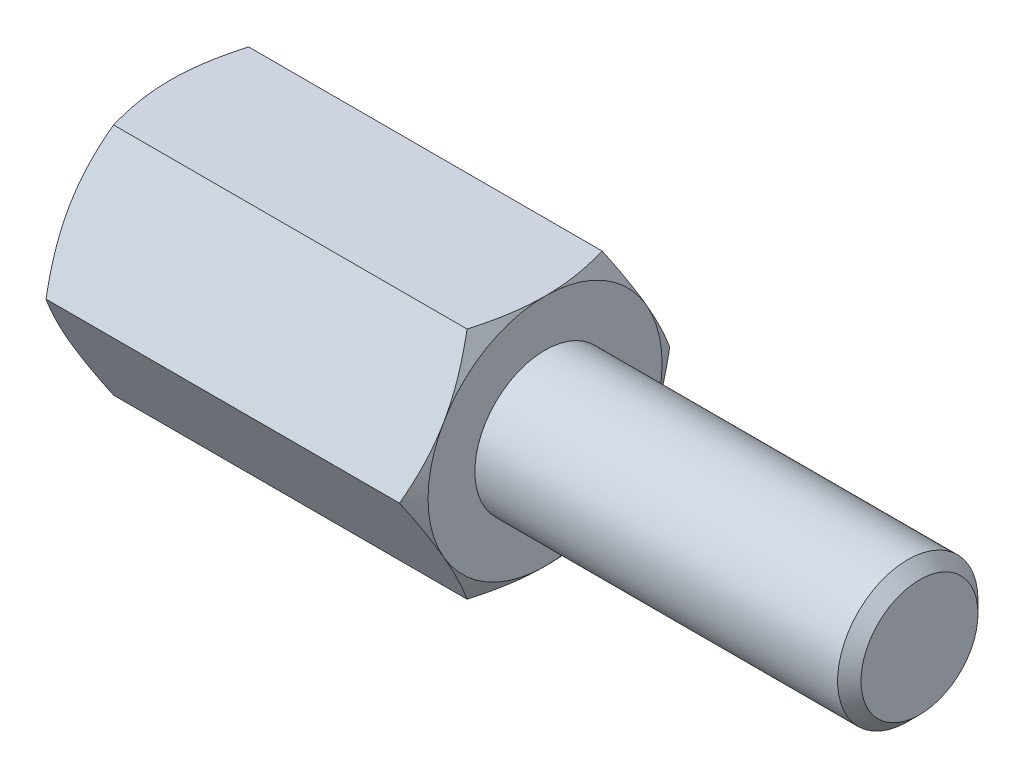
from build123d import *

# Parameters (mm, degrees)
EXTRUDE2_DEPTH = 4
SKETCH3_R      = 1.25
EXTRUDE3_DEPTH = 5
SKETCH5_R      = 1.5
EXTRUDE4_DEPTH = 8
CHAMFER1_SIZE  = 0.25


with BuildPart() as part:
    # Sketch1 → Extrude2 (new, symmetric)
    with BuildSketch(Plane(origin=(0, 0, 0), x_dir=(0, 0, -1), z_dir=(1, 0, 0))):
        Polygon((1.443375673, 2.5), (-1.443375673, 2.5), (-2.886751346, 0), (-1.443375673, -2.5), (1.443375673, -2.5), (2.886751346, 0), align=None)
    extrude(amount=EXTRUDE2_DEPTH, both=True)

    # Sketch2 → Cut-Revolve1 (revolve, cut)
    with BuildSketch(Plane.XY):
        with BuildLine():
            Line((-4, 2.5), (-2.5, 5.098076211))
            ThreePointArc((-2.5, 5.098076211), (-2.98810136, 6.276457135), (-4, 5.5))
            Line((-4, 5.5), (-4, 2.5))
        make_face()
    cut_revolve1 = revolve(axis=Axis((0, 0, 0), (1, 0, 0)), mode=Mode.SUBTRACT)

    # Mirror1: Cut-Revolve1 across plane
    add(cut_revolve1.mirror(Plane(origin=(0, 0, 0), x_dir=(0, 0, 1), z_dir=(1, 0, 0))), mode=Mode.SUBTRACT)

    # Sketch3 → Extrude3 (cut)
    with BuildSketch(Plane.ZY.offset(4)):
        Circle(SKETCH3_R)
    extrude(amount=-EXTRUDE3_DEPTH, mode=Mode.SUBTRACT)

    # Sketch4 → Cut-Revolve2 (revolve, cut)
    with BuildSketch(Plane.XY, mode=Mode.PRIVATE) as cut_revolve2_sk:
        Polygon((1, 0), (1, 1.25), (1.721687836, 0), align=None)
    revolve(cut_revolve2_sk.sketch.rotate(Axis((1.721687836, 0, 0), (-1, 0, 0)), 270), axis=Axis((1.721687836, 0, 0), (-1, 0, 0)), mode=Mode.SUBTRACT)

    # Sketch5 → Extrude4 (add)
    with BuildSketch(Plane(origin=(4, 0, 0), x_dir=(0, 0, -1), z_dir=(1, 0, 0))):
        Circle(SKETCH5_R)
    extrude(amount=EXTRUDE4_DEPTH)

    # Chamfer1
    chamfer1_edges = [part.edges().sort_by_distance(p)[0] for p in [
        (12, 0, 1.5),
    ]]
    chamfer(chamfer1_edges, length=CHAMFER1_SIZE)


solid = part.part
